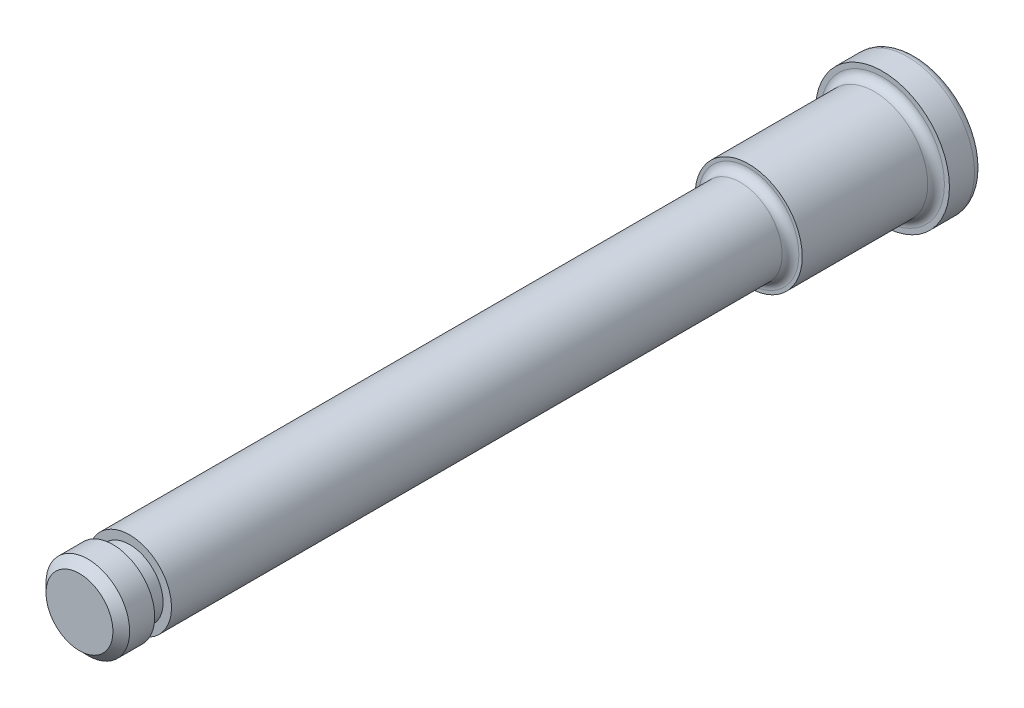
ISO-10303-21;
HEADER;
FILE_DESCRIPTION(('STEP AP214'),'2;1');
FILE_NAME('part.step','',(''),(''),'','','');
FILE_SCHEMA(('AUTOMOTIVE_DESIGN { 1 0 10303 214 1 1 1 1 }'));
ENDSEC;
DATA;
#1=APPLICATION_CONTEXT('core data for automotive mechanical design processes');
#2=APPLICATION_PROTOCOL_DEFINITION('international standard','automotive_design',2000,#1);
#3=PRODUCT_CONTEXT('',#1,'mechanical');
#4=PRODUCT('Part','Part','',(#3));
#5=PRODUCT_RELATED_PRODUCT_CATEGORY('part','',(#4));
#6=PRODUCT_DEFINITION_FORMATION('','',#4);
#7=PRODUCT_DEFINITION_CONTEXT('part definition',#1,'design');
#8=PRODUCT_DEFINITION('design','',#6,#7);
#9=PRODUCT_DEFINITION_SHAPE('','',#8);
#10=(LENGTH_UNIT() NAMED_UNIT(*) SI_UNIT(.MILLI.,.METRE.));
#11=(NAMED_UNIT(*) PLANE_ANGLE_UNIT() SI_UNIT($,.RADIAN.));
#12=(NAMED_UNIT(*) SI_UNIT($,.STERADIAN.) SOLID_ANGLE_UNIT());
#13=UNCERTAINTY_MEASURE_WITH_UNIT(LENGTH_MEASURE(1.E-05),#10,'distance_accuracy_value','');
#14=(GEOMETRIC_REPRESENTATION_CONTEXT(3) GLOBAL_UNCERTAINTY_ASSIGNED_CONTEXT((#13)) GLOBAL_UNIT_ASSIGNED_CONTEXT((#10,
#11,#12)) REPRESENTATION_CONTEXT('',''));
#15=CARTESIAN_POINT('',(0.,0.,0.));
#16=DIRECTION('',(0.,0.,1.));
#17=DIRECTION('',(1.,0.,0.));
#18=AXIS2_PLACEMENT_3D('',#15,#16,#17);
#19=CARTESIAN_POINT('',(0.,0.,10.));
#20=DIRECTION('',(0.,0.,1.));
#21=DIRECTION('',(1.,0.,0.));
#22=AXIS2_PLACEMENT_3D('',#19,#20,#21);
#23=PLANE('',#22);
#24=CARTESIAN_POINT('',(0.,0.,10.));
#25=DIRECTION('',(0.,0.,1.));
#26=DIRECTION('',(1.,0.,0.));
#27=AXIS2_PLACEMENT_3D('',#24,#25,#26);
#28=CIRCLE('',#27,3.);
#29=CARTESIAN_POINT('',(3.,0.,10.));
#30=VERTEX_POINT('',#29);
#31=EDGE_CURVE('E33',#30,#30,#28,.F.);
#32=ORIENTED_EDGE('',*,*,#31,.T.);
#33=EDGE_LOOP('',(#32));
#34=FACE_BOUND('',#33,.T.);
#35=CARTESIAN_POINT('',(0.,0.,10.));
#36=DIRECTION('',(0.,0.,1.));
#37=DIRECTION('',(1.,0.,0.));
#38=AXIS2_PLACEMENT_3D('',#35,#36,#37);
#39=CIRCLE('',#38,3.2);
#40=CARTESIAN_POINT('',(3.2,0.,10.));
#41=VERTEX_POINT('',#40);
#42=EDGE_CURVE('E57',#41,#41,#39,.T.);
#43=ORIENTED_EDGE('',*,*,#42,.T.);
#44=EDGE_LOOP('',(#43));
#45=FACE_BOUND('',#44,.T.);
#46=ADVANCED_FACE('F22',(#34,#45),#23,.T.);
#47=CARTESIAN_POINT('',(0.,0.,2.));
#48=DIRECTION('',(0.,0.,1.));
#49=DIRECTION('',(1.,0.,0.));
#50=AXIS2_PLACEMENT_3D('',#47,#48,#49);
#51=PLANE('',#50);
#52=CARTESIAN_POINT('',(0.,0.,2.));
#53=DIRECTION('',(0.,0.,1.));
#54=DIRECTION('',(1.,0.,0.));
#55=AXIS2_PLACEMENT_3D('',#52,#53,#54);
#56=CIRCLE('',#55,3.7);
#57=CARTESIAN_POINT('',(3.7,0.,2.));
#58=VERTEX_POINT('',#57);
#59=EDGE_CURVE('E48',#58,#58,#56,.F.);
#60=ORIENTED_EDGE('',*,*,#59,.T.);
#61=EDGE_LOOP('',(#60));
#62=FACE_BOUND('',#61,.T.);
#63=CARTESIAN_POINT('',(0.,0.,2.));
#64=DIRECTION('',(0.,0.,1.));
#65=DIRECTION('',(1.,0.,0.));
#66=AXIS2_PLACEMENT_3D('',#63,#64,#65);
#67=CIRCLE('',#66,4.);
#68=CARTESIAN_POINT('',(4.,0.,2.));
#69=VERTEX_POINT('',#68);
#70=EDGE_CURVE('E54',#69,#69,#67,.T.);
#71=ORIENTED_EDGE('',*,*,#70,.T.);
#72=EDGE_LOOP('',(#71));
#73=FACE_BOUND('',#72,.T.);
#74=ADVANCED_FACE('F101',(#62,#73),#51,.T.);
#75=CARTESIAN_POINT('',(0.,0.,2.));
#76=DIRECTION('',(0.,0.,-1.));
#77=DIRECTION('',(-1.,0.,0.));
#78=AXIS2_PLACEMENT_3D('',#75,#76,#77);
#79=CYLINDRICAL_SURFACE('',#78,4.);
#80=CARTESIAN_POINT('',(0.,0.,0.5));
#81=DIRECTION('',(0.,0.,1.));
#82=DIRECTION('',(1.,0.,0.));
#83=AXIS2_PLACEMENT_3D('',#80,#81,#82);
#84=CIRCLE('',#83,4.);
#85=CARTESIAN_POINT('',(4.,0.,0.5));
#86=VERTEX_POINT('',#85);
#87=EDGE_CURVE('E45',#86,#86,#84,.T.);
#88=ORIENTED_EDGE('',*,*,#87,.T.);
#89=EDGE_LOOP('',(#88));
#90=FACE_BOUND('',#89,.T.);
#91=ORIENTED_EDGE('',*,*,#70,.F.);
#92=EDGE_LOOP('',(#91));
#93=FACE_BOUND('',#92,.T.);
#94=ADVANCED_FACE('F24',(#90,#93),#79,.T.);
#95=CARTESIAN_POINT('',(0.,0.,0.));
#96=DIRECTION('',(0.,0.,1.));
#97=DIRECTION('',(1.,0.,0.));
#98=AXIS2_PLACEMENT_3D('',#95,#96,#97);
#99=PLANE('',#98);
#100=CARTESIAN_POINT('',(0.,0.,0.));
#101=DIRECTION('',(0.,0.,1.));
#102=DIRECTION('',(1.,0.,0.));
#103=AXIS2_PLACEMENT_3D('',#100,#101,#102);
#104=CIRCLE('',#103,3.5);
#105=CARTESIAN_POINT('',(3.5,0.,0.));
#106=VERTEX_POINT('',#105);
#107=EDGE_CURVE('E42',#106,#106,#104,.F.);
#108=ORIENTED_EDGE('',*,*,#107,.T.);
#109=EDGE_LOOP('',(#108));
#110=FACE_BOUND('',#109,.T.);
#111=ADVANCED_FACE('F111',(#110),#99,.F.);
#112=CARTESIAN_POINT('',(0.,0.,10.));
#113=DIRECTION('',(0.,0.,-1.));
#114=DIRECTION('',(-1.,0.,0.));
#115=AXIS2_PLACEMENT_3D('',#112,#113,#114);
#116=CYLINDRICAL_SURFACE('',#115,3.2);
#117=CARTESIAN_POINT('',(0.,0.,2.5));
#118=DIRECTION('',(0.,0.,1.));
#119=DIRECTION('',(1.,0.,0.));
#120=AXIS2_PLACEMENT_3D('',#117,#118,#119);
#121=CIRCLE('',#120,3.2);
#122=CARTESIAN_POINT('',(3.2,0.,2.5));
#123=VERTEX_POINT('',#122);
#124=EDGE_CURVE('E51',#123,#123,#121,.T.);
#125=ORIENTED_EDGE('',*,*,#124,.T.);
#126=EDGE_LOOP('',(#125));
#127=FACE_BOUND('',#126,.T.);
#128=ORIENTED_EDGE('',*,*,#42,.F.);
#129=EDGE_LOOP('',(#128));
#130=FACE_BOUND('',#129,.T.);
#131=ADVANCED_FACE('F98',(#127,#130),#116,.T.);
#132=CARTESIAN_POINT('',(0.,0.,50.));
#133=DIRECTION('',(0.,0.,-1.));
#134=DIRECTION('',(-1.,0.,0.));
#135=AXIS2_PLACEMENT_3D('',#132,#133,#134);
#136=CYLINDRICAL_SURFACE('',#135,2.5);
#137=CARTESIAN_POINT('',(0.,0.,47.));
#138=DIRECTION('',(0.,0.,-1.));
#139=DIRECTION('',(-1.,0.,0.));
#140=AXIS2_PLACEMENT_3D('',#137,#138,#139);
#141=CIRCLE('',#140,2.5);
#142=CARTESIAN_POINT('',(-2.5,0.,47.));
#143=VERTEX_POINT('',#142);
#144=EDGE_CURVE('E63',#143,#143,#141,.T.);
#145=ORIENTED_EDGE('',*,*,#144,.T.);
#146=EDGE_LOOP('',(#145));
#147=FACE_BOUND('',#146,.T.);
#148=CARTESIAN_POINT('',(0.,0.,10.5));
#149=DIRECTION('',(0.,0.,1.));
#150=DIRECTION('',(1.,0.,0.));
#151=AXIS2_PLACEMENT_3D('',#148,#149,#150);
#152=CIRCLE('',#151,2.5);
#153=CARTESIAN_POINT('',(2.5,0.,10.5));
#154=VERTEX_POINT('',#153);
#155=EDGE_CURVE('E37',#154,#154,#152,.T.);
#156=ORIENTED_EDGE('',*,*,#155,.T.);
#157=EDGE_LOOP('',(#156));
#158=FACE_BOUND('',#157,.T.);
#159=ADVANCED_FACE('F87',(#147,#158),#136,.T.);
#160=CARTESIAN_POINT('',(0.,0.,2.5));
#161=DIRECTION('',(0.,0.,1.));
#162=DIRECTION('',(1.,0.,0.));
#163=AXIS2_PLACEMENT_3D('',#160,#161,#162);
#164=TOROIDAL_SURFACE('',#163,3.7,0.5);
#165=ORIENTED_EDGE('',*,*,#59,.F.);
#166=EDGE_LOOP('',(#165));
#167=FACE_BOUND('',#166,.T.);
#168=ORIENTED_EDGE('',*,*,#124,.F.);
#169=EDGE_LOOP('',(#168));
#170=FACE_BOUND('',#169,.T.);
#171=ADVANCED_FACE('F97',(#167,#170),#164,.F.);
#172=CARTESIAN_POINT('',(0.,0.,0.5));
#173=DIRECTION('',(0.,0.,1.));
#174=DIRECTION('',(1.,0.,0.));
#175=AXIS2_PLACEMENT_3D('',#172,#173,#174);
#176=TOROIDAL_SURFACE('',#175,3.5,0.5);
#177=ORIENTED_EDGE('',*,*,#107,.F.);
#178=EDGE_LOOP('',(#177));
#179=FACE_BOUND('',#178,.T.);
#180=ORIENTED_EDGE('',*,*,#87,.F.);
#181=EDGE_LOOP('',(#180));
#182=FACE_BOUND('',#181,.T.);
#183=ADVANCED_FACE('F121',(#179,#182),#176,.T.);
#184=CARTESIAN_POINT('',(0.,0.,10.5));
#185=DIRECTION('',(0.,0.,1.));
#186=DIRECTION('',(1.,0.,0.));
#187=AXIS2_PLACEMENT_3D('',#184,#185,#186);
#188=TOROIDAL_SURFACE('',#187,3.,0.5);
#189=ORIENTED_EDGE('',*,*,#31,.F.);
#190=EDGE_LOOP('',(#189));
#191=FACE_BOUND('',#190,.T.);
#192=ORIENTED_EDGE('',*,*,#155,.F.);
#193=EDGE_LOOP('',(#192));
#194=FACE_BOUND('',#193,.T.);
#195=ADVANCED_FACE('F79',(#191,#194),#188,.F.);
#196=CARTESIAN_POINT('',(0.,2.,48.));
#197=DIRECTION('',(0.,0.,1.));
#198=DIRECTION('',(1.,0.,0.));
#199=AXIS2_PLACEMENT_3D('',#196,#197,#198);
#200=PLANE('',#199);
#201=CARTESIAN_POINT('',(0.,0.,48.));
#202=DIRECTION('',(0.,0.,-1.));
#203=DIRECTION('',(-1.,0.,0.));
#204=AXIS2_PLACEMENT_3D('',#201,#202,#203);
#205=CIRCLE('',#204,2.);
#206=CARTESIAN_POINT('',(-2.,0.,48.));
#207=VERTEX_POINT('',#206);
#208=EDGE_CURVE('E69',#207,#207,#205,.T.);
#209=ORIENTED_EDGE('',*,*,#208,.F.);
#210=EDGE_LOOP('',(#209));
#211=FACE_BOUND('',#210,.T.);
#212=CARTESIAN_POINT('',(0.,0.,48.));
#213=DIRECTION('',(0.,0.,-1.));
#214=DIRECTION('',(-1.,0.,0.));
#215=AXIS2_PLACEMENT_3D('',#212,#213,#214);
#216=CIRCLE('',#215,2.5);
#217=CARTESIAN_POINT('',(-2.5,0.,48.));
#218=VERTEX_POINT('',#217);
#219=EDGE_CURVE('E60',#218,#218,#216,.T.);
#220=ORIENTED_EDGE('',*,*,#219,.T.);
#221=EDGE_LOOP('',(#220));
#222=FACE_BOUND('',#221,.T.);
#223=ADVANCED_FACE('F75',(#211,#222),#200,.F.);
#224=CARTESIAN_POINT('',(0.,2.,47.));
#225=DIRECTION('',(0.,0.,-1.));
#226=DIRECTION('',(-1.,0.,0.));
#227=AXIS2_PLACEMENT_3D('',#224,#225,#226);
#228=PLANE('',#227);
#229=ORIENTED_EDGE('',*,*,#144,.F.);
#230=EDGE_LOOP('',(#229));
#231=FACE_BOUND('',#230,.T.);
#232=CARTESIAN_POINT('',(0.,0.,47.));
#233=DIRECTION('',(0.,0.,-1.));
#234=DIRECTION('',(-1.,0.,0.));
#235=AXIS2_PLACEMENT_3D('',#232,#233,#234);
#236=CIRCLE('',#235,2.);
#237=CARTESIAN_POINT('',(-2.,0.,47.));
#238=VERTEX_POINT('',#237);
#239=EDGE_CURVE('E66',#238,#238,#236,.T.);
#240=ORIENTED_EDGE('',*,*,#239,.T.);
#241=EDGE_LOOP('',(#240));
#242=FACE_BOUND('',#241,.T.);
#243=ADVANCED_FACE('F78',(#231,#242),#228,.F.);
#244=CARTESIAN_POINT('',(0.,0.,0.));
#245=DIRECTION('',(0.,0.,-1.));
#246=DIRECTION('',(-1.,0.,0.));
#247=AXIS2_PLACEMENT_3D('',#244,#245,#246);
#248=CYLINDRICAL_SURFACE('',#247,2.);
#249=ORIENTED_EDGE('',*,*,#239,.F.);
#250=EDGE_LOOP('',(#249));
#251=FACE_BOUND('',#250,.T.);
#252=ORIENTED_EDGE('',*,*,#208,.T.);
#253=EDGE_LOOP('',(#252));
#254=FACE_BOUND('',#253,.T.);
#255=ADVANCED_FACE('F73',(#251,#254),#248,.T.);
#256=CARTESIAN_POINT('',(0.,0.,50.));
#257=DIRECTION('',(0.,0.,1.));
#258=DIRECTION('',(1.,0.,0.));
#259=AXIS2_PLACEMENT_3D('',#256,#257,#258);
#260=PLANE('',#259);
#261=CARTESIAN_POINT('',(0.,0.,50.));
#262=DIRECTION('',(0.,0.,1.));
#263=DIRECTION('',(1.,0.,0.));
#264=AXIS2_PLACEMENT_3D('',#261,#262,#263);
#265=CIRCLE('',#264,1.99999999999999);
#266=CARTESIAN_POINT('',(1.99999999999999,0.,50.));
#267=VERTEX_POINT('',#266);
#268=EDGE_CURVE('E29',#267,#267,#265,.T.);
#269=ORIENTED_EDGE('',*,*,#268,.T.);
#270=EDGE_LOOP('',(#269));
#271=FACE_BOUND('',#270,.T.);
#272=ADVANCED_FACE('F91',(#271),#260,.T.);
#273=CARTESIAN_POINT('',(0.,0.,50.));
#274=DIRECTION('',(0.,0.,-1.));
#275=DIRECTION('',(-1.,0.,0.));
#276=AXIS2_PLACEMENT_3D('',#273,#274,#275);
#277=CONICAL_SURFACE('',#276,1.99999999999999,0.785398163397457);
#278=CARTESIAN_POINT('',(0.,0.,49.5));
#279=DIRECTION('',(0.,0.,1.));
#280=DIRECTION('',(1.,0.,0.));
#281=AXIS2_PLACEMENT_3D('',#278,#279,#280);
#282=CIRCLE('',#281,2.5);
#283=CARTESIAN_POINT('',(2.5,0.,49.5));
#284=VERTEX_POINT('',#283);
#285=EDGE_CURVE('E10',#284,#284,#282,.F.);
#286=ORIENTED_EDGE('',*,*,#285,.F.);
#287=EDGE_LOOP('',(#286));
#288=FACE_BOUND('',#287,.T.);
#289=ORIENTED_EDGE('',*,*,#268,.F.);
#290=EDGE_LOOP('',(#289));
#291=FACE_BOUND('',#290,.T.);
#292=ADVANCED_FACE('F85',(#288,#291),#277,.T.);
#293=ORIENTED_EDGE('',*,*,#219,.F.);
#294=EDGE_LOOP('',(#293));
#295=FACE_BOUND('',#294,.T.);
#296=ORIENTED_EDGE('',*,*,#285,.T.);
#297=EDGE_LOOP('',(#296));
#298=FACE_BOUND('',#297,.T.);
#299=ADVANCED_FACE('F83',(#295,#298),#136,.T.);
#300=CLOSED_SHELL('',(#46,#74,#94,#111,#131,#159,#171,#183,#195,#223,#243,#255,#272,#292,#299));
#301=MANIFOLD_SOLID_BREP('B2',#300);
#302=ADVANCED_BREP_SHAPE_REPRESENTATION('',(#18,#301),#14);
#303=SHAPE_DEFINITION_REPRESENTATION(#9,#302);
ENDSEC;
END-ISO-10303-21;
